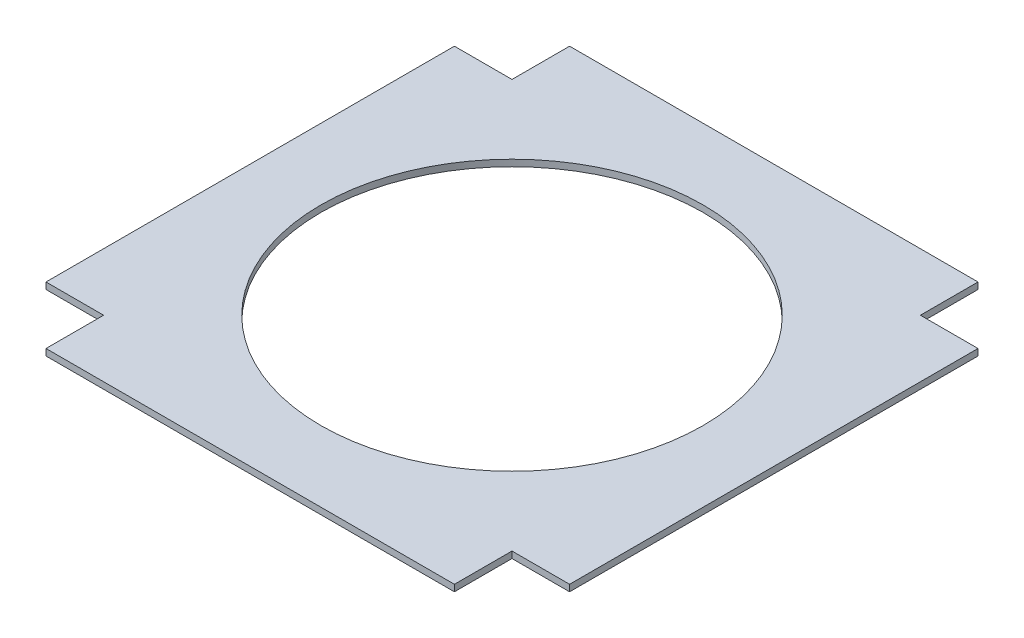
from build123d import *

# Parameters (mm, degrees)
SKETCH1_R           = 92.71
BOSS_EXTRUDE1_DEPTH = 3.175


with BuildPart() as part:
    # Sketch1 → Boss-Extrude1 (new body)
    with BuildSketch(Plane(origin=(0, 0, 0), x_dir=(1, 0, 0), z_dir=(0, 1, 0))):
        Polygon((-99.06, -99.06), (-99.06, -127), (99.06, -127), (99.06, -99.06), (127, -99.06), (127, 99.06), (99.06, 99.06), (99.06, 127), (-99.06, 127), (-99.06, 99.06), (-127, 99.06), (-127, -99.06), align=None)
        with Locations(Location((0, 0, 0), (0, 0, 270))):
            Circle(SKETCH1_R, mode=Mode.SUBTRACT)
    extrude(amount=BOSS_EXTRUDE1_DEPTH)


solid = part.part
